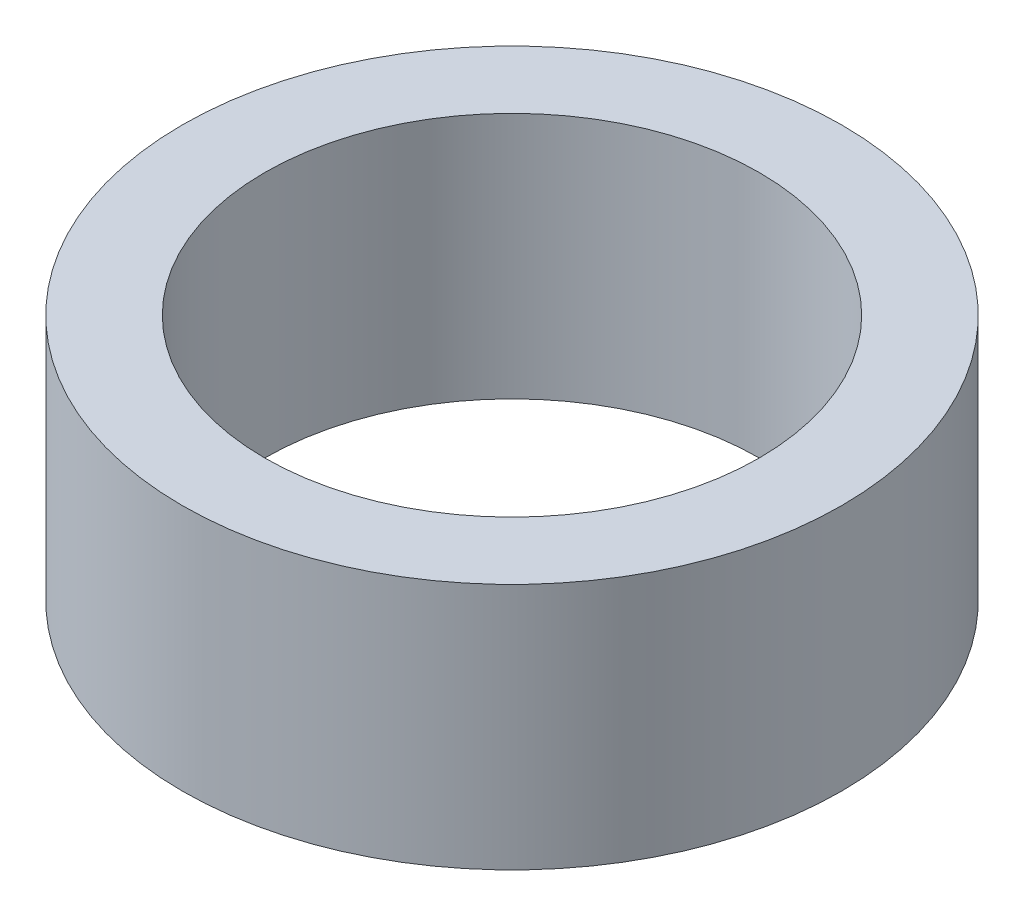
ISO-10303-21;
HEADER;
FILE_DESCRIPTION(('STEP AP214'),'2;1');
FILE_NAME('part.step','',(''),(''),'','','');
FILE_SCHEMA(('AUTOMOTIVE_DESIGN { 1 0 10303 214 1 1 1 1 }'));
ENDSEC;
DATA;
#1=APPLICATION_CONTEXT('core data for automotive mechanical design processes');
#2=APPLICATION_PROTOCOL_DEFINITION('international standard','automotive_design',2000,#1);
#3=PRODUCT_CONTEXT('',#1,'mechanical');
#4=PRODUCT('Part','Part','',(#3));
#5=PRODUCT_RELATED_PRODUCT_CATEGORY('part','',(#4));
#6=PRODUCT_DEFINITION_FORMATION('','',#4);
#7=PRODUCT_DEFINITION_CONTEXT('part definition',#1,'design');
#8=PRODUCT_DEFINITION('design','',#6,#7);
#9=PRODUCT_DEFINITION_SHAPE('','',#8);
#10=(LENGTH_UNIT() NAMED_UNIT(*) SI_UNIT(.MILLI.,.METRE.));
#11=(NAMED_UNIT(*) PLANE_ANGLE_UNIT() SI_UNIT($,.RADIAN.));
#12=(NAMED_UNIT(*) SI_UNIT($,.STERADIAN.) SOLID_ANGLE_UNIT());
#13=UNCERTAINTY_MEASURE_WITH_UNIT(LENGTH_MEASURE(1.E-05),#10,'distance_accuracy_value','');
#14=(GEOMETRIC_REPRESENTATION_CONTEXT(3) GLOBAL_UNCERTAINTY_ASSIGNED_CONTEXT((#13)) GLOBAL_UNIT_ASSIGNED_CONTEXT((#10,
#11,#12)) REPRESENTATION_CONTEXT('',''));
#15=CARTESIAN_POINT('',(0.,0.,0.));
#16=DIRECTION('',(0.,0.,1.));
#17=DIRECTION('',(1.,0.,0.));
#18=AXIS2_PLACEMENT_3D('',#15,#16,#17);
#19=CARTESIAN_POINT('',(0.,1.5,0.));
#20=DIRECTION('',(0.,1.,0.));
#21=DIRECTION('',(0.,0.,1.));
#22=AXIS2_PLACEMENT_3D('',#19,#20,#21);
#23=PLANE('',#22);
#24=CARTESIAN_POINT('',(0.,1.5,0.));
#25=DIRECTION('',(0.,1.,0.));
#26=DIRECTION('',(0.,0.,1.));
#27=AXIS2_PLACEMENT_3D('',#24,#25,#26);
#28=CIRCLE('',#27,2.);
#29=CARTESIAN_POINT('',(0.,1.5,2.));
#30=VERTEX_POINT('',#29);
#31=EDGE_CURVE('E10',#30,#30,#28,.T.);
#32=ORIENTED_EDGE('',*,*,#31,.T.);
#33=EDGE_LOOP('',(#32));
#34=FACE_BOUND('',#33,.T.);
#35=CARTESIAN_POINT('',(0.,1.5,0.));
#36=DIRECTION('',(0.,1.,0.));
#37=DIRECTION('',(0.,0.,1.));
#38=AXIS2_PLACEMENT_3D('',#35,#36,#37);
#39=CIRCLE('',#38,1.5);
#40=CARTESIAN_POINT('',(0.,1.5,1.5));
#41=VERTEX_POINT('',#40);
#42=EDGE_CURVE('E44',#41,#41,#39,.T.);
#43=ORIENTED_EDGE('',*,*,#42,.F.);
#44=EDGE_LOOP('',(#43));
#45=FACE_BOUND('',#44,.T.);
#46=ADVANCED_FACE('F33',(#34,#45),#23,.T.);
#47=CARTESIAN_POINT('',(0.,0.,0.));
#48=DIRECTION('',(0.,1.,0.));
#49=DIRECTION('',(0.,0.,1.));
#50=AXIS2_PLACEMENT_3D('',#47,#48,#49);
#51=PLANE('',#50);
#52=CARTESIAN_POINT('',(0.,0.,0.));
#53=DIRECTION('',(0.,1.,0.));
#54=DIRECTION('',(0.,0.,1.));
#55=AXIS2_PLACEMENT_3D('',#52,#53,#54);
#56=CIRCLE('',#55,2.);
#57=CARTESIAN_POINT('',(0.,0.,2.));
#58=VERTEX_POINT('',#57);
#59=EDGE_CURVE('E37',#58,#58,#56,.T.);
#60=ORIENTED_EDGE('',*,*,#59,.F.);
#61=EDGE_LOOP('',(#60));
#62=FACE_BOUND('',#61,.T.);
#63=CARTESIAN_POINT('',(0.,0.,0.));
#64=DIRECTION('',(0.,1.,0.));
#65=DIRECTION('',(0.,0.,1.));
#66=AXIS2_PLACEMENT_3D('',#63,#64,#65);
#67=CIRCLE('',#66,1.5);
#68=CARTESIAN_POINT('',(0.,0.,1.5));
#69=VERTEX_POINT('',#68);
#70=EDGE_CURVE('E46',#69,#69,#67,.T.);
#71=ORIENTED_EDGE('',*,*,#70,.T.);
#72=EDGE_LOOP('',(#71));
#73=FACE_BOUND('',#72,.T.);
#74=ADVANCED_FACE('F56',(#62,#73),#51,.F.);
#75=CARTESIAN_POINT('',(0.,1.5,0.));
#76=DIRECTION('',(0.,-1.,0.));
#77=DIRECTION('',(0.,0.,-1.));
#78=AXIS2_PLACEMENT_3D('',#75,#76,#77);
#79=CYLINDRICAL_SURFACE('',#78,2.);
#80=ORIENTED_EDGE('',*,*,#31,.F.);
#81=EDGE_LOOP('',(#80));
#82=FACE_BOUND('',#81,.T.);
#83=ORIENTED_EDGE('',*,*,#59,.T.);
#84=EDGE_LOOP('',(#83));
#85=FACE_BOUND('',#84,.T.);
#86=ADVANCED_FACE('F35',(#82,#85),#79,.T.);
#87=CARTESIAN_POINT('',(0.,1.5,0.));
#88=DIRECTION('',(0.,-1.,0.));
#89=DIRECTION('',(0.,0.,-1.));
#90=AXIS2_PLACEMENT_3D('',#87,#88,#89);
#91=CYLINDRICAL_SURFACE('',#90,1.5);
#92=ORIENTED_EDGE('',*,*,#42,.T.);
#93=EDGE_LOOP('',(#92));
#94=FACE_BOUND('',#93,.T.);
#95=ORIENTED_EDGE('',*,*,#70,.F.);
#96=EDGE_LOOP('',(#95));
#97=FACE_BOUND('',#96,.T.);
#98=ADVANCED_FACE('F52',(#94,#97),#91,.F.);
#99=CLOSED_SHELL('',(#46,#74,#86,#98));
#100=MANIFOLD_SOLID_BREP('B2',#99);
#101=ADVANCED_BREP_SHAPE_REPRESENTATION('',(#18,#100),#14);
#102=SHAPE_DEFINITION_REPRESENTATION(#9,#101);
ENDSEC;
END-ISO-10303-21;
